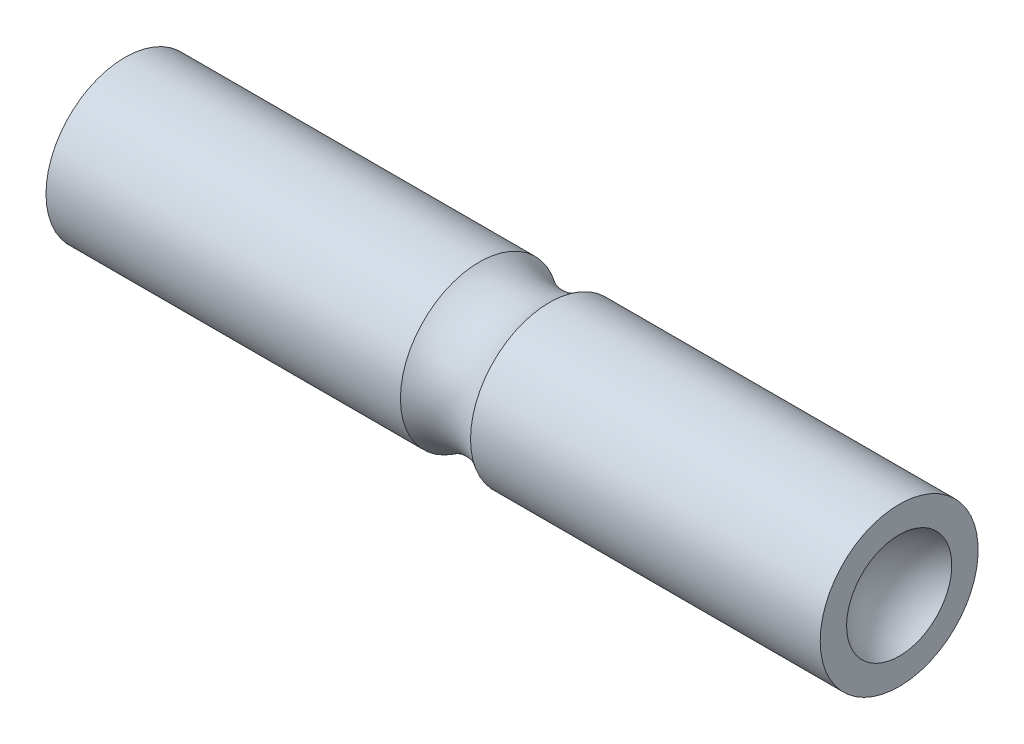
ISO-10303-21;
HEADER;
FILE_DESCRIPTION(('STEP AP214'),'2;1');
FILE_NAME('part.step','',(''),(''),'','','');
FILE_SCHEMA(('AUTOMOTIVE_DESIGN { 1 0 10303 214 1 1 1 1 }'));
ENDSEC;
DATA;
#1=APPLICATION_CONTEXT('core data for automotive mechanical design processes');
#2=APPLICATION_PROTOCOL_DEFINITION('international standard','automotive_design',2000,#1);
#3=PRODUCT_CONTEXT('',#1,'mechanical');
#4=PRODUCT('Part','Part','',(#3));
#5=PRODUCT_RELATED_PRODUCT_CATEGORY('part','',(#4));
#6=PRODUCT_DEFINITION_FORMATION('','',#4);
#7=PRODUCT_DEFINITION_CONTEXT('part definition',#1,'design');
#8=PRODUCT_DEFINITION('design','',#6,#7);
#9=PRODUCT_DEFINITION_SHAPE('','',#8);
#10=(LENGTH_UNIT() NAMED_UNIT(*) SI_UNIT(.MILLI.,.METRE.));
#11=(NAMED_UNIT(*) PLANE_ANGLE_UNIT() SI_UNIT($,.RADIAN.));
#12=(NAMED_UNIT(*) SI_UNIT($,.STERADIAN.) SOLID_ANGLE_UNIT());
#13=UNCERTAINTY_MEASURE_WITH_UNIT(LENGTH_MEASURE(1.E-05),#10,'distance_accuracy_value','');
#14=(GEOMETRIC_REPRESENTATION_CONTEXT(3) GLOBAL_UNCERTAINTY_ASSIGNED_CONTEXT((#13)) GLOBAL_UNIT_ASSIGNED_CONTEXT((#10,
#11,#12)) REPRESENTATION_CONTEXT('',''));
#15=CARTESIAN_POINT('',(0.,0.,0.));
#16=DIRECTION('',(0.,0.,1.));
#17=DIRECTION('',(1.,0.,0.));
#18=AXIS2_PLACEMENT_3D('',#15,#16,#17);
#19=CARTESIAN_POINT('',(4.064,0.,0.));
#20=DIRECTION('',(-1.,0.,0.));
#21=DIRECTION('',(0.,1.,0.));
#22=AXIS2_PLACEMENT_3D('',#19,#20,#21);
#23=SPHERICAL_SURFACE('',#22,4.064);
#24=CARTESIAN_POINT('',(0.515628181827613,0.,0.));
#25=DIRECTION('',(-1.,0.,0.));
#26=DIRECTION('',(0.,0.,1.));
#27=AXIS2_PLACEMENT_3D('',#24,#25,#26);
#28=CIRCLE('',#27,1.9812);
#29=CARTESIAN_POINT('',(0.515628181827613,0.,1.9812));
#30=VERTEX_POINT('',#29);
#31=EDGE_CURVE('E50',#30,#30,#28,.T.);
#32=ORIENTED_EDGE('',*,*,#31,.T.);
#33=EDGE_LOOP('',(#32));
#34=FACE_BOUND('',#33,.T.);
#35=ADVANCED_FACE('F31',(#34),#23,.T.);
#36=CARTESIAN_POINT('',(20.701,0.,0.));
#37=DIRECTION('',(-1.,0.,0.));
#38=DIRECTION('',(0.,1.,0.));
#39=AXIS2_PLACEMENT_3D('',#36,#37,#38);
#40=SPHERICAL_SURFACE('',#39,1.524);
#41=CARTESIAN_POINT('',(19.939,0.,0.));
#42=DIRECTION('',(-1.,0.,0.));
#43=DIRECTION('',(0.,0.,1.));
#44=AXIS2_PLACEMENT_3D('',#41,#42,#43);
#45=CIRCLE('',#44,1.31982271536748);
#46=CARTESIAN_POINT('',(19.939,0.,1.31982271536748));
#47=VERTEX_POINT('',#46);
#48=EDGE_CURVE('E10',#47,#47,#45,.T.);
#49=ORIENTED_EDGE('',*,*,#48,.F.);
#50=EDGE_LOOP('',(#49));
#51=FACE_BOUND('',#50,.T.);
#52=ADVANCED_FACE('F74',(#51),#40,.F.);
#53=CARTESIAN_POINT('',(19.939,0.,0.));
#54=DIRECTION('',(-1.,0.,0.));
#55=DIRECTION('',(0.,0.,1.));
#56=AXIS2_PLACEMENT_3D('',#53,#54,#55);
#57=PLANE('',#56);
#58=CARTESIAN_POINT('',(19.939,0.,0.));
#59=DIRECTION('',(-1.,0.,0.));
#60=DIRECTION('',(0.,0.,1.));
#61=AXIS2_PLACEMENT_3D('',#58,#59,#60);
#62=CIRCLE('',#61,1.9812);
#63=CARTESIAN_POINT('',(19.939,0.,1.9812));
#64=VERTEX_POINT('',#63);
#65=EDGE_CURVE('E37',#64,#64,#62,.T.);
#66=ORIENTED_EDGE('',*,*,#65,.F.);
#67=EDGE_LOOP('',(#66));
#68=FACE_BOUND('',#67,.T.);
#69=ORIENTED_EDGE('',*,*,#48,.T.);
#70=EDGE_LOOP('',(#69));
#71=FACE_BOUND('',#70,.T.);
#72=ADVANCED_FACE('F69',(#68,#71),#57,.F.);
#73=CARTESIAN_POINT('',(0.733818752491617,0.,0.));
#74=DIRECTION('',(-1.,0.,0.));
#75=DIRECTION('',(0.,0.,1.));
#76=AXIS2_PLACEMENT_3D('',#73,#74,#75);
#77=CYLINDRICAL_SURFACE('',#76,1.9812);
#78=CARTESIAN_POINT('',(11.1665151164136,0.,0.));
#79=DIRECTION('',(-1.,0.,0.));
#80=DIRECTION('',(0.,0.,1.));
#81=AXIS2_PLACEMENT_3D('',#78,#79,#80);
#82=CIRCLE('',#81,1.9812);
#83=CARTESIAN_POINT('',(11.1665151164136,0.,1.9812));
#84=VERTEX_POINT('',#83);
#85=EDGE_CURVE('E41',#84,#84,#82,.T.);
#86=ORIENTED_EDGE('',*,*,#85,.F.);
#87=EDGE_LOOP('',(#86));
#88=FACE_BOUND('',#87,.T.);
#89=ORIENTED_EDGE('',*,*,#65,.T.);
#90=EDGE_LOOP('',(#89));
#91=FACE_BOUND('',#90,.T.);
#92=ADVANCED_FACE('F64',(#88,#91),#77,.T.);
#93=CARTESIAN_POINT('',(10.287,0.,0.));
#94=DIRECTION('',(-1.,0.,0.));
#95=DIRECTION('',(0.,0.,1.));
#96=AXIS2_PLACEMENT_3D('',#93,#94,#95);
#97=TOROIDAL_SURFACE('',#96,3.2258,1.524);
#98=CARTESIAN_POINT('',(9.40748488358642,0.,0.));
#99=DIRECTION('',(-1.,0.,0.));
#100=DIRECTION('',(0.,0.,1.));
#101=AXIS2_PLACEMENT_3D('',#98,#99,#100);
#102=CIRCLE('',#101,1.9812);
#103=CARTESIAN_POINT('',(9.40748488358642,0.,1.9812));
#104=VERTEX_POINT('',#103);
#105=EDGE_CURVE('E45',#104,#104,#102,.T.);
#106=ORIENTED_EDGE('',*,*,#105,.F.);
#107=EDGE_LOOP('',(#106));
#108=FACE_BOUND('',#107,.T.);
#109=ORIENTED_EDGE('',*,*,#85,.T.);
#110=EDGE_LOOP('',(#109));
#111=FACE_BOUND('',#110,.T.);
#112=ADVANCED_FACE('F58',(#108,#111),#97,.F.);
#113=CARTESIAN_POINT('',(0.733818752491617,0.,0.));
#114=DIRECTION('',(-1.,0.,0.));
#115=DIRECTION('',(0.,0.,1.));
#116=AXIS2_PLACEMENT_3D('',#113,#114,#115);
#117=CYLINDRICAL_SURFACE('',#116,1.9812);
#118=ORIENTED_EDGE('',*,*,#31,.F.);
#119=EDGE_LOOP('',(#118));
#120=FACE_BOUND('',#119,.T.);
#121=ORIENTED_EDGE('',*,*,#105,.T.);
#122=EDGE_LOOP('',(#121));
#123=FACE_BOUND('',#122,.T.);
#124=ADVANCED_FACE('F55',(#120,#123),#117,.T.);
#125=CLOSED_SHELL('',(#35,#52,#72,#92,#112,#124));
#126=MANIFOLD_SOLID_BREP('B2',#125);
#127=ADVANCED_BREP_SHAPE_REPRESENTATION('',(#18,#126),#14);
#128=SHAPE_DEFINITION_REPRESENTATION(#9,#127);
ENDSEC;
END-ISO-10303-21;
